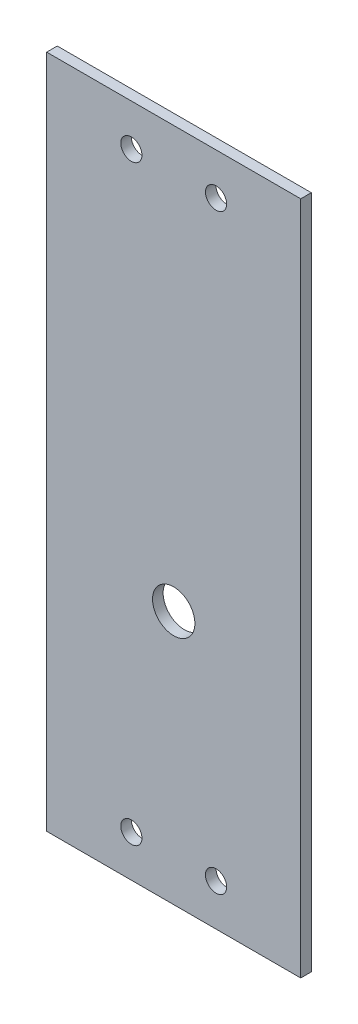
from build123d import *

# Parameters (mm, degrees)
SKETCH1_W           = 76.2
SKETCH1_H           = 202.4
BOSS_EXTRUDE1_DEPTH = 3.175
SKETCH2_R           = 3.175
SKETCH2_R_2         = 6.35
CUT_EXTRUDE1_DEPTH  = 3.175


with BuildPart() as part:
    # Sketch1 → Boss-Extrude1 (new body)
    with BuildSketch(Plane.XY):
        with Locations((38.1, -101.2)):
            Rectangle(SKETCH1_W, SKETCH1_H)
    extrude(amount=BOSS_EXTRUDE1_DEPTH)

    # Sketch2 → Cut-Extrude1 (cut)
    with BuildSketch(Plane.XY.offset(3.175)):
        with Locations((25.4, -12.5)):
            Circle(SKETCH2_R)
        with Locations((50.8, -12.5)):
            Circle(SKETCH2_R)
        with Locations((50.8, -189.9)):
            Circle(SKETCH2_R)
        with Locations((25.4, -189.9)):
            Circle(SKETCH2_R)
        with Locations((38.1, -126.2)):
            Circle(SKETCH2_R_2)
    extrude(amount=-CUT_EXTRUDE1_DEPTH, mode=Mode.SUBTRACT)


solid = part.part
